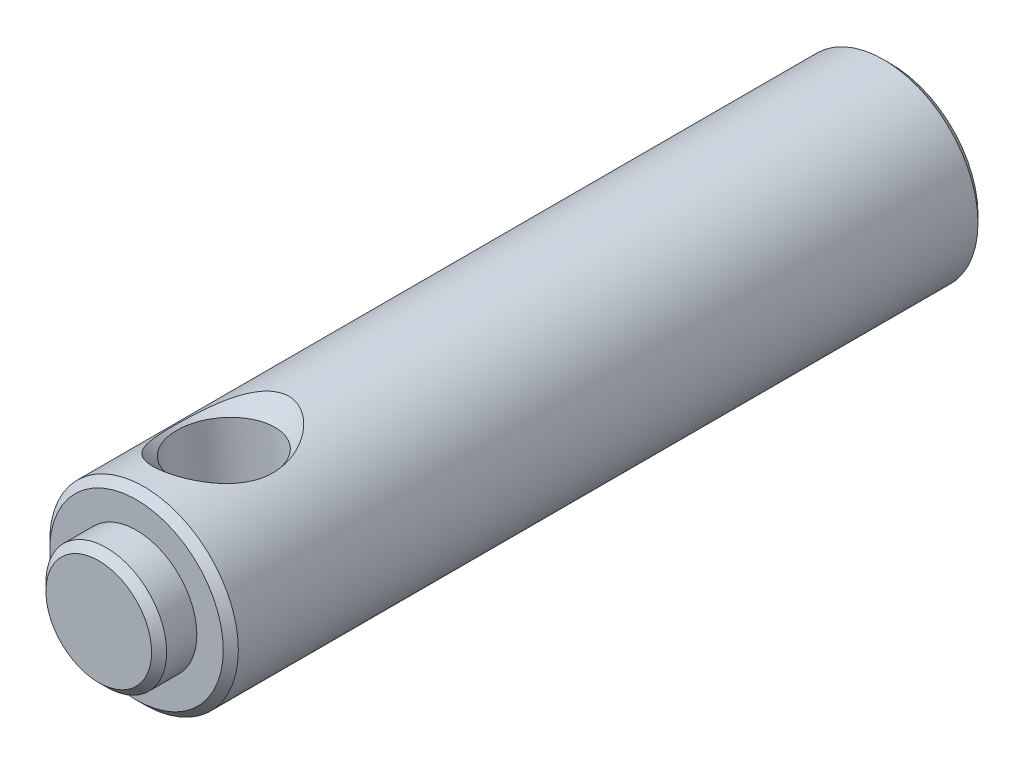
from build123d import *

# Parameters (mm, degrees)
SKIZZE1_R                       = 2.5
AUFSATZ_LINEAR_AUSTRAGEN1_DEPTH = 20
SKIZZE2_R                       = 1.6
DORN_F_R_FEDER_DEPTH            = 1
FASE1_SIZE                      = 0.2


with BuildPart() as part:
    # Skizze1 → Aufsatz-Linear austragen1 (new body)
    with BuildSketch(Plane.XY):
        Circle(SKIZZE1_R)
    extrude(amount=AUFSATZ_LINEAR_AUSTRAGEN1_DEPTH)

    # Skizze2 → Dorn f_r Feder (add)
    with BuildSketch(Plane.XY.offset(20)):
        Circle(SKIZZE2_R)
    extrude(amount=DORN_F_R_FEDER_DEPTH)

    # Skizze3 → M3 Gewindebohrung1 (revolve, cut)
    with BuildSketch(Plane(origin=(-0.225669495, 2.489793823, 17.5), x_dir=(-0.9959175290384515, -0.09026779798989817, 0), z_dir=(0, 0, 1))):
        Polygon((0, 0), (0, 5), (1.7, 5), (1.25, 4.55), (1.25, 0.45), (1.7, 0), align=None)
    revolve(axis=Axis((-0.798870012, 8.813870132, 17.5), (0.09026779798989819, -0.9959175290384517, 0)), mode=Mode.SUBTRACT)

    # Fase1
    fase1_edges = [part.edges().sort_by_distance(p)[0] for p in [
        (-2.5, 0, 0),
        (-2.5, 0, 20),
        (-1.6, 0, 21),
    ]]
    chamfer(fase1_edges, length=FASE1_SIZE)


solid = part.part
